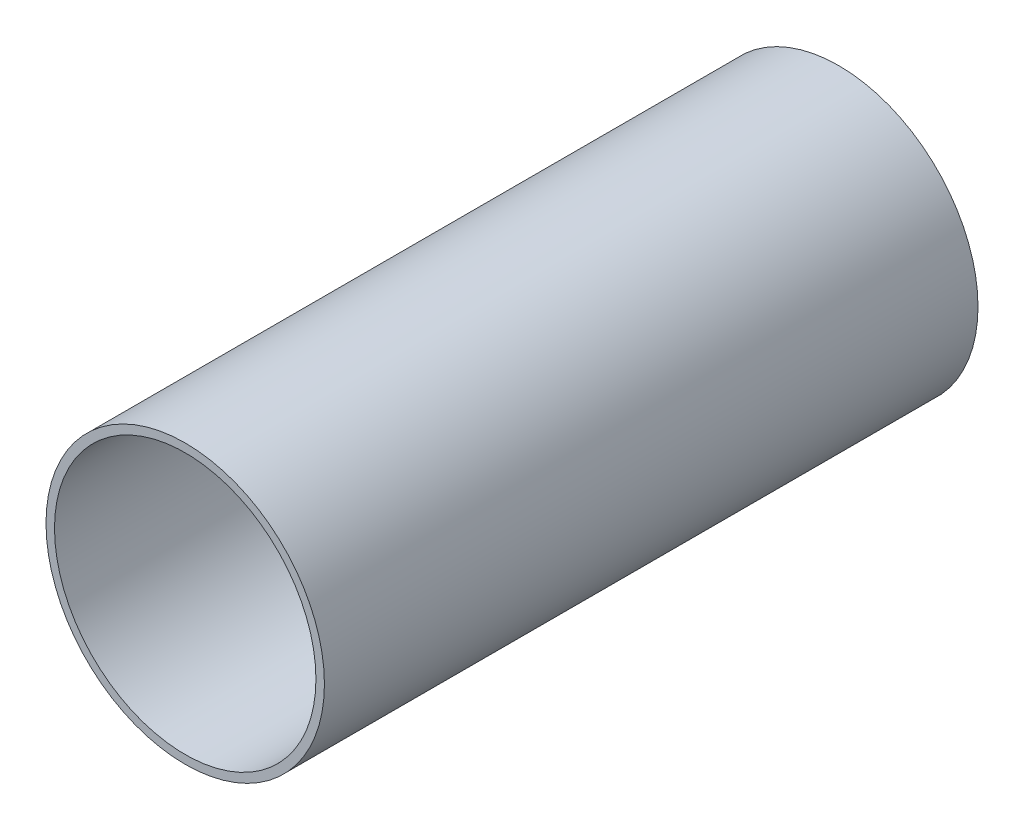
ISO-10303-21;
HEADER;
FILE_DESCRIPTION(('STEP AP214'),'2;1');
FILE_NAME('part.step','',(''),(''),'','','');
FILE_SCHEMA(('AUTOMOTIVE_DESIGN { 1 0 10303 214 1 1 1 1 }'));
ENDSEC;
DATA;
#1=APPLICATION_CONTEXT('core data for automotive mechanical design processes');
#2=APPLICATION_PROTOCOL_DEFINITION('international standard','automotive_design',2000,#1);
#3=PRODUCT_CONTEXT('',#1,'mechanical');
#4=PRODUCT('Part','Part','',(#3));
#5=PRODUCT_RELATED_PRODUCT_CATEGORY('part','',(#4));
#6=PRODUCT_DEFINITION_FORMATION('','',#4);
#7=PRODUCT_DEFINITION_CONTEXT('part definition',#1,'design');
#8=PRODUCT_DEFINITION('design','',#6,#7);
#9=PRODUCT_DEFINITION_SHAPE('','',#8);
#10=(LENGTH_UNIT() NAMED_UNIT(*) SI_UNIT(.MILLI.,.METRE.));
#11=(NAMED_UNIT(*) PLANE_ANGLE_UNIT() SI_UNIT($,.RADIAN.));
#12=(NAMED_UNIT(*) SI_UNIT($,.STERADIAN.) SOLID_ANGLE_UNIT());
#13=UNCERTAINTY_MEASURE_WITH_UNIT(LENGTH_MEASURE(1.E-05),#10,'distance_accuracy_value','');
#14=(GEOMETRIC_REPRESENTATION_CONTEXT(3) GLOBAL_UNCERTAINTY_ASSIGNED_CONTEXT((#13)) GLOBAL_UNIT_ASSIGNED_CONTEXT((#10,
#11,#12)) REPRESENTATION_CONTEXT('',''));
#15=CARTESIAN_POINT('',(0.,0.,0.));
#16=DIRECTION('',(0.,0.,1.));
#17=DIRECTION('',(1.,0.,0.));
#18=AXIS2_PLACEMENT_3D('',#15,#16,#17);
#19=CARTESIAN_POINT('',(0.,0.,127.));
#20=DIRECTION('',(0.,0.,1.));
#21=DIRECTION('',(1.,0.,0.));
#22=AXIS2_PLACEMENT_3D('',#19,#20,#21);
#23=PLANE('',#22);
#24=CARTESIAN_POINT('',(0.,0.,127.));
#25=DIRECTION('',(0.,0.,1.));
#26=DIRECTION('',(1.,0.,0.));
#27=AXIS2_PLACEMENT_3D('',#24,#25,#26);
#28=CIRCLE('',#27,27.051);
#29=CARTESIAN_POINT('',(27.051,0.,127.));
#30=VERTEX_POINT('',#29);
#31=EDGE_CURVE('E10',#30,#30,#28,.T.);
#32=ORIENTED_EDGE('',*,*,#31,.T.);
#33=EDGE_LOOP('',(#32));
#34=FACE_BOUND('',#33,.T.);
#35=CARTESIAN_POINT('',(0.,0.,127.));
#36=DIRECTION('',(0.,0.,1.));
#37=DIRECTION('',(1.,0.,0.));
#38=AXIS2_PLACEMENT_3D('',#35,#36,#37);
#39=CIRCLE('',#38,25.4);
#40=CARTESIAN_POINT('',(25.4,0.,127.));
#41=VERTEX_POINT('',#40);
#42=EDGE_CURVE('E40',#41,#41,#39,.T.);
#43=ORIENTED_EDGE('',*,*,#42,.F.);
#44=EDGE_LOOP('',(#43));
#45=FACE_BOUND('',#44,.T.);
#46=ADVANCED_FACE('F29',(#34,#45),#23,.T.);
#47=CARTESIAN_POINT('',(0.,0.,0.));
#48=DIRECTION('',(0.,0.,1.));
#49=DIRECTION('',(1.,0.,0.));
#50=AXIS2_PLACEMENT_3D('',#47,#48,#49);
#51=PLANE('',#50);
#52=CARTESIAN_POINT('',(0.,0.,0.));
#53=DIRECTION('',(0.,0.,1.));
#54=DIRECTION('',(1.,0.,0.));
#55=AXIS2_PLACEMENT_3D('',#52,#53,#54);
#56=CIRCLE('',#55,27.051);
#57=CARTESIAN_POINT('',(27.051,0.,0.));
#58=VERTEX_POINT('',#57);
#59=EDGE_CURVE('E36',#58,#58,#56,.T.);
#60=ORIENTED_EDGE('',*,*,#59,.F.);
#61=EDGE_LOOP('',(#60));
#62=FACE_BOUND('',#61,.T.);
#63=CARTESIAN_POINT('',(0.,0.,0.));
#64=DIRECTION('',(0.,0.,1.));
#65=DIRECTION('',(1.,0.,0.));
#66=AXIS2_PLACEMENT_3D('',#63,#64,#65);
#67=CIRCLE('',#66,25.4);
#68=CARTESIAN_POINT('',(25.4,0.,0.));
#69=VERTEX_POINT('',#68);
#70=EDGE_CURVE('E44',#69,#69,#67,.T.);
#71=ORIENTED_EDGE('',*,*,#70,.T.);
#72=EDGE_LOOP('',(#71));
#73=FACE_BOUND('',#72,.T.);
#74=ADVANCED_FACE('F50',(#62,#73),#51,.F.);
#75=CARTESIAN_POINT('',(0.,0.,127.));
#76=DIRECTION('',(0.,0.,-1.));
#77=DIRECTION('',(-1.,0.,0.));
#78=AXIS2_PLACEMENT_3D('',#75,#76,#77);
#79=CYLINDRICAL_SURFACE('',#78,27.051);
#80=ORIENTED_EDGE('',*,*,#31,.F.);
#81=EDGE_LOOP('',(#80));
#82=FACE_BOUND('',#81,.T.);
#83=ORIENTED_EDGE('',*,*,#59,.T.);
#84=EDGE_LOOP('',(#83));
#85=FACE_BOUND('',#84,.T.);
#86=ADVANCED_FACE('F31',(#82,#85),#79,.T.);
#87=CARTESIAN_POINT('',(0.,0.,127.));
#88=DIRECTION('',(0.,0.,-1.));
#89=DIRECTION('',(-1.,0.,0.));
#90=AXIS2_PLACEMENT_3D('',#87,#88,#89);
#91=CYLINDRICAL_SURFACE('',#90,25.4);
#92=ORIENTED_EDGE('',*,*,#42,.T.);
#93=EDGE_LOOP('',(#92));
#94=FACE_BOUND('',#93,.T.);
#95=ORIENTED_EDGE('',*,*,#70,.F.);
#96=EDGE_LOOP('',(#95));
#97=FACE_BOUND('',#96,.T.);
#98=ADVANCED_FACE('F52',(#94,#97),#91,.F.);
#99=CLOSED_SHELL('',(#46,#74,#86,#98));
#100=MANIFOLD_SOLID_BREP('B2',#99);
#101=ADVANCED_BREP_SHAPE_REPRESENTATION('',(#18,#100),#14);
#102=SHAPE_DEFINITION_REPRESENTATION(#9,#101);
ENDSEC;
END-ISO-10303-21;
